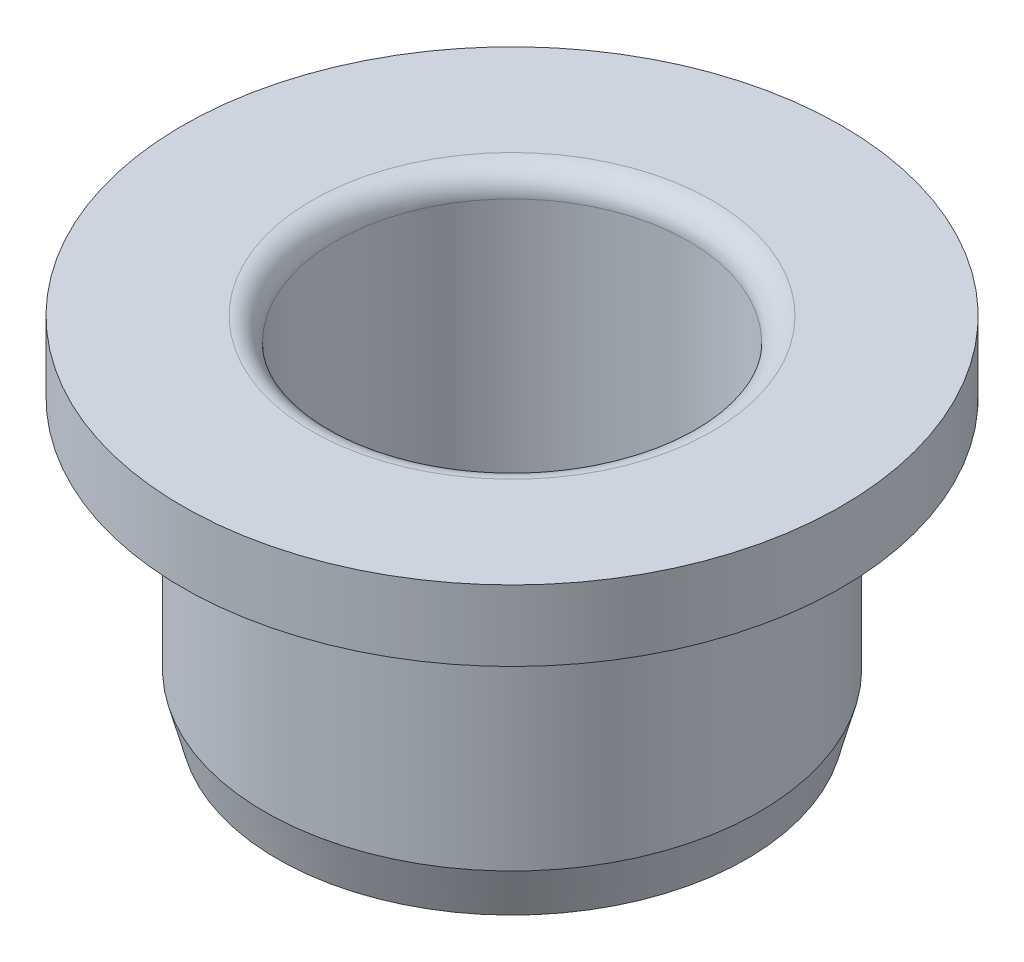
ISO-10303-21;
HEADER;
FILE_DESCRIPTION(('STEP AP214'),'2;1');
FILE_NAME('part.step','',(''),(''),'','','');
FILE_SCHEMA(('AUTOMOTIVE_DESIGN { 1 0 10303 214 1 1 1 1 }'));
ENDSEC;
DATA;
#1=APPLICATION_CONTEXT('core data for automotive mechanical design processes');
#2=APPLICATION_PROTOCOL_DEFINITION('international standard','automotive_design',2000,#1);
#3=PRODUCT_CONTEXT('',#1,'mechanical');
#4=PRODUCT('Part','Part','',(#3));
#5=PRODUCT_RELATED_PRODUCT_CATEGORY('part','',(#4));
#6=PRODUCT_DEFINITION_FORMATION('','',#4);
#7=PRODUCT_DEFINITION_CONTEXT('part definition',#1,'design');
#8=PRODUCT_DEFINITION('design','',#6,#7);
#9=PRODUCT_DEFINITION_SHAPE('','',#8);
#10=(LENGTH_UNIT() NAMED_UNIT(*) SI_UNIT(.MILLI.,.METRE.));
#11=(NAMED_UNIT(*) PLANE_ANGLE_UNIT() SI_UNIT($,.RADIAN.));
#12=(NAMED_UNIT(*) SI_UNIT($,.STERADIAN.) SOLID_ANGLE_UNIT());
#13=UNCERTAINTY_MEASURE_WITH_UNIT(LENGTH_MEASURE(1.E-05),#10,'distance_accuracy_value','');
#14=(GEOMETRIC_REPRESENTATION_CONTEXT(3) GLOBAL_UNCERTAINTY_ASSIGNED_CONTEXT((#13)) GLOBAL_UNIT_ASSIGNED_CONTEXT((#10,
#11,#12)) REPRESENTATION_CONTEXT('',''));
#15=CARTESIAN_POINT('',(0.,0.,0.));
#16=DIRECTION('',(0.,0.,1.));
#17=DIRECTION('',(1.,0.,0.));
#18=AXIS2_PLACEMENT_3D('',#15,#16,#17);
#19=CARTESIAN_POINT('',(0.,0.,0.));
#20=DIRECTION('',(0.,-1.,0.));
#21=DIRECTION('',(0.,0.,-1.));
#22=AXIS2_PLACEMENT_3D('',#19,#20,#21);
#23=CYLINDRICAL_SURFACE('',#22,14.);
#24=CARTESIAN_POINT('',(0.,15.,0.));
#25=DIRECTION('',(0.,-1.,0.));
#26=DIRECTION('',(0.,0.,-1.));
#27=AXIS2_PLACEMENT_3D('',#24,#25,#26);
#28=CIRCLE('',#27,14.);
#29=CARTESIAN_POINT('',(0.,15.,-14.));
#30=VERTEX_POINT('',#29);
#31=EDGE_CURVE('E10',#30,#30,#28,.T.);
#32=ORIENTED_EDGE('',*,*,#31,.T.);
#33=EDGE_LOOP('',(#32));
#34=FACE_BOUND('',#33,.T.);
#35=CARTESIAN_POINT('',(0.,12.,0.));
#36=DIRECTION('',(0.,-1.,0.));
#37=DIRECTION('',(0.,0.,-1.));
#38=AXIS2_PLACEMENT_3D('',#35,#36,#37);
#39=CIRCLE('',#38,14.);
#40=CARTESIAN_POINT('',(0.,12.,-14.));
#41=VERTEX_POINT('',#40);
#42=EDGE_CURVE('E62',#41,#41,#39,.T.);
#43=ORIENTED_EDGE('',*,*,#42,.F.);
#44=EDGE_LOOP('',(#43));
#45=FACE_BOUND('',#44,.T.);
#46=ADVANCED_FACE('F28',(#34,#45),#23,.T.);
#47=CARTESIAN_POINT('',(8.5,15.,0.));
#48=DIRECTION('',(0.,1.,0.));
#49=DIRECTION('',(0.,0.,1.));
#50=AXIS2_PLACEMENT_3D('',#47,#48,#49);
#51=PLANE('',#50);
#52=CARTESIAN_POINT('',(0.,15.,0.));
#53=DIRECTION('',(0.,-1.,0.));
#54=DIRECTION('',(0.,0.,-1.));
#55=AXIS2_PLACEMENT_3D('',#52,#53,#54);
#56=CIRCLE('',#55,8.5);
#57=CARTESIAN_POINT('',(0.,15.,-8.5));
#58=VERTEX_POINT('',#57);
#59=EDGE_CURVE('E34',#58,#58,#56,.T.);
#60=ORIENTED_EDGE('',*,*,#59,.T.);
#61=EDGE_LOOP('',(#60));
#62=FACE_BOUND('',#61,.T.);
#63=ORIENTED_EDGE('',*,*,#31,.F.);
#64=EDGE_LOOP('',(#63));
#65=FACE_BOUND('',#64,.T.);
#66=ADVANCED_FACE('F70',(#62,#65),#51,.T.);
#67=CARTESIAN_POINT('',(0.,14.,0.));
#68=DIRECTION('',(0.,-1.,0.));
#69=DIRECTION('',(0.,0.,-1.));
#70=AXIS2_PLACEMENT_3D('',#67,#68,#69);
#71=TOROIDAL_SURFACE('',#70,8.5,1.);
#72=CARTESIAN_POINT('',(0.,14.,0.));
#73=DIRECTION('',(0.,-1.,0.));
#74=DIRECTION('',(0.,0.,-1.));
#75=AXIS2_PLACEMENT_3D('',#72,#73,#74);
#76=CIRCLE('',#75,7.5);
#77=CARTESIAN_POINT('',(0.,14.,-7.5));
#78=VERTEX_POINT('',#77);
#79=EDGE_CURVE('E38',#78,#78,#76,.T.);
#80=ORIENTED_EDGE('',*,*,#79,.T.);
#81=EDGE_LOOP('',(#80));
#82=FACE_BOUND('',#81,.T.);
#83=ORIENTED_EDGE('',*,*,#59,.F.);
#84=EDGE_LOOP('',(#83));
#85=FACE_BOUND('',#84,.T.);
#86=ADVANCED_FACE('F74',(#82,#85),#71,.T.);
#87=CARTESIAN_POINT('',(0.,0.,0.));
#88=DIRECTION('',(0.,-1.,0.));
#89=DIRECTION('',(0.,0.,-1.));
#90=AXIS2_PLACEMENT_3D('',#87,#88,#89);
#91=CYLINDRICAL_SURFACE('',#90,7.5);
#92=CARTESIAN_POINT('',(0.,1.,0.));
#93=DIRECTION('',(0.,-1.,0.));
#94=DIRECTION('',(0.,0.,-1.));
#95=AXIS2_PLACEMENT_3D('',#92,#93,#94);
#96=CIRCLE('',#95,7.5);
#97=CARTESIAN_POINT('',(0.,1.,-7.49999999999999));
#98=VERTEX_POINT('',#97);
#99=EDGE_CURVE('E42',#98,#98,#96,.T.);
#100=ORIENTED_EDGE('',*,*,#99,.T.);
#101=EDGE_LOOP('',(#100));
#102=FACE_BOUND('',#101,.T.);
#103=ORIENTED_EDGE('',*,*,#79,.F.);
#104=EDGE_LOOP('',(#103));
#105=FACE_BOUND('',#104,.T.);
#106=ADVANCED_FACE('F78',(#102,#105),#91,.F.);
#107=CARTESIAN_POINT('',(0.,1.,0.));
#108=DIRECTION('',(0.,-1.,0.));
#109=DIRECTION('',(0.,0.,-1.));
#110=AXIS2_PLACEMENT_3D('',#107,#108,#109);
#111=TOROIDAL_SURFACE('',#110,8.5,1.);
#112=CARTESIAN_POINT('',(0.,0.,0.));
#113=DIRECTION('',(0.,-1.,0.));
#114=DIRECTION('',(0.,0.,-1.));
#115=AXIS2_PLACEMENT_3D('',#112,#113,#114);
#116=CIRCLE('',#115,8.5);
#117=CARTESIAN_POINT('',(0.,0.,-8.5));
#118=VERTEX_POINT('',#117);
#119=EDGE_CURVE('E47',#118,#118,#116,.T.);
#120=ORIENTED_EDGE('',*,*,#119,.T.);
#121=EDGE_LOOP('',(#120));
#122=FACE_BOUND('',#121,.T.);
#123=ORIENTED_EDGE('',*,*,#99,.F.);
#124=EDGE_LOOP('',(#123));
#125=FACE_BOUND('',#124,.T.);
#126=ADVANCED_FACE('F85',(#122,#125),#111,.T.);
#127=CARTESIAN_POINT('',(8.5,0.,0.));
#128=DIRECTION('',(0.,-1.,0.));
#129=DIRECTION('',(0.,0.,-1.));
#130=AXIS2_PLACEMENT_3D('',#127,#128,#129);
#131=PLANE('',#130);
#132=CARTESIAN_POINT('',(0.,0.,0.));
#133=DIRECTION('',(0.,-1.,0.));
#134=DIRECTION('',(0.,0.,-1.));
#135=AXIS2_PLACEMENT_3D('',#132,#133,#134);
#136=CIRCLE('',#135,9.96410161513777);
#137=CARTESIAN_POINT('',(0.,0.,-9.96410161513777));
#138=VERTEX_POINT('',#137);
#139=EDGE_CURVE('E50',#138,#138,#136,.T.);
#140=ORIENTED_EDGE('',*,*,#139,.T.);
#141=EDGE_LOOP('',(#140));
#142=FACE_BOUND('',#141,.T.);
#143=ORIENTED_EDGE('',*,*,#119,.F.);
#144=EDGE_LOOP('',(#143));
#145=FACE_BOUND('',#144,.T.);
#146=ADVANCED_FACE('F89',(#142,#145),#131,.T.);
#147=CARTESIAN_POINT('',(0.,0.,0.));
#148=DIRECTION('',(0.,1.,0.));
#149=DIRECTION('',(0.,0.,1.));
#150=AXIS2_PLACEMENT_3D('',#147,#148,#149);
#151=CONICAL_SURFACE('',#150,9.96410161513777,0.261799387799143);
#152=CARTESIAN_POINT('',(0.,2.,0.));
#153=DIRECTION('',(0.,-1.,0.));
#154=DIRECTION('',(0.,0.,-1.));
#155=AXIS2_PLACEMENT_3D('',#152,#153,#154);
#156=CIRCLE('',#155,10.5);
#157=CARTESIAN_POINT('',(0.,2.,-10.5));
#158=VERTEX_POINT('',#157);
#159=EDGE_CURVE('E53',#158,#158,#156,.T.);
#160=ORIENTED_EDGE('',*,*,#159,.T.);
#161=EDGE_LOOP('',(#160));
#162=FACE_BOUND('',#161,.T.);
#163=ORIENTED_EDGE('',*,*,#139,.F.);
#164=EDGE_LOOP('',(#163));
#165=FACE_BOUND('',#164,.T.);
#166=ADVANCED_FACE('F93',(#162,#165),#151,.T.);
#167=CARTESIAN_POINT('',(0.,0.,0.));
#168=DIRECTION('',(0.,-1.,0.));
#169=DIRECTION('',(0.,0.,-1.));
#170=AXIS2_PLACEMENT_3D('',#167,#168,#169);
#171=CYLINDRICAL_SURFACE('',#170,10.5);
#172=CARTESIAN_POINT('',(0.,11.5,0.));
#173=DIRECTION('',(0.,-1.,0.));
#174=DIRECTION('',(0.,0.,-1.));
#175=AXIS2_PLACEMENT_3D('',#172,#173,#174);
#176=CIRCLE('',#175,10.5);
#177=CARTESIAN_POINT('',(0.,11.5,-10.5));
#178=VERTEX_POINT('',#177);
#179=EDGE_CURVE('E56',#178,#178,#176,.T.);
#180=ORIENTED_EDGE('',*,*,#179,.T.);
#181=EDGE_LOOP('',(#180));
#182=FACE_BOUND('',#181,.T.);
#183=ORIENTED_EDGE('',*,*,#159,.F.);
#184=EDGE_LOOP('',(#183));
#185=FACE_BOUND('',#184,.T.);
#186=ADVANCED_FACE('F97',(#182,#185),#171,.T.);
#187=CARTESIAN_POINT('',(0.,11.5,0.));
#188=DIRECTION('',(0.,-1.,0.));
#189=DIRECTION('',(0.,0.,-1.));
#190=AXIS2_PLACEMENT_3D('',#187,#188,#189);
#191=TOROIDAL_SURFACE('',#190,11.,0.5);
#192=CARTESIAN_POINT('',(0.,12.,0.));
#193=DIRECTION('',(0.,-1.,0.));
#194=DIRECTION('',(0.,0.,-1.));
#195=AXIS2_PLACEMENT_3D('',#192,#193,#194);
#196=CIRCLE('',#195,11.);
#197=CARTESIAN_POINT('',(0.,12.,-11.));
#198=VERTEX_POINT('',#197);
#199=EDGE_CURVE('E59',#198,#198,#196,.T.);
#200=ORIENTED_EDGE('',*,*,#199,.T.);
#201=EDGE_LOOP('',(#200));
#202=FACE_BOUND('',#201,.T.);
#203=ORIENTED_EDGE('',*,*,#179,.F.);
#204=EDGE_LOOP('',(#203));
#205=FACE_BOUND('',#204,.T.);
#206=ADVANCED_FACE('F101',(#202,#205),#191,.F.);
#207=CARTESIAN_POINT('',(14.,12.,0.));
#208=DIRECTION('',(0.,-1.,0.));
#209=DIRECTION('',(0.,0.,-1.));
#210=AXIS2_PLACEMENT_3D('',#207,#208,#209);
#211=PLANE('',#210);
#212=ORIENTED_EDGE('',*,*,#42,.T.);
#213=EDGE_LOOP('',(#212));
#214=FACE_BOUND('',#213,.T.);
#215=ORIENTED_EDGE('',*,*,#199,.F.);
#216=EDGE_LOOP('',(#215));
#217=FACE_BOUND('',#216,.T.);
#218=ADVANCED_FACE('F66',(#214,#217),#211,.T.);
#219=CLOSED_SHELL('',(#46,#66,#86,#106,#126,#146,#166,#186,#206,#218));
#220=MANIFOLD_SOLID_BREP('B2',#219);
#221=ADVANCED_BREP_SHAPE_REPRESENTATION('',(#18,#220),#14);
#222=SHAPE_DEFINITION_REPRESENTATION(#9,#221);
ENDSEC;
END-ISO-10303-21;
